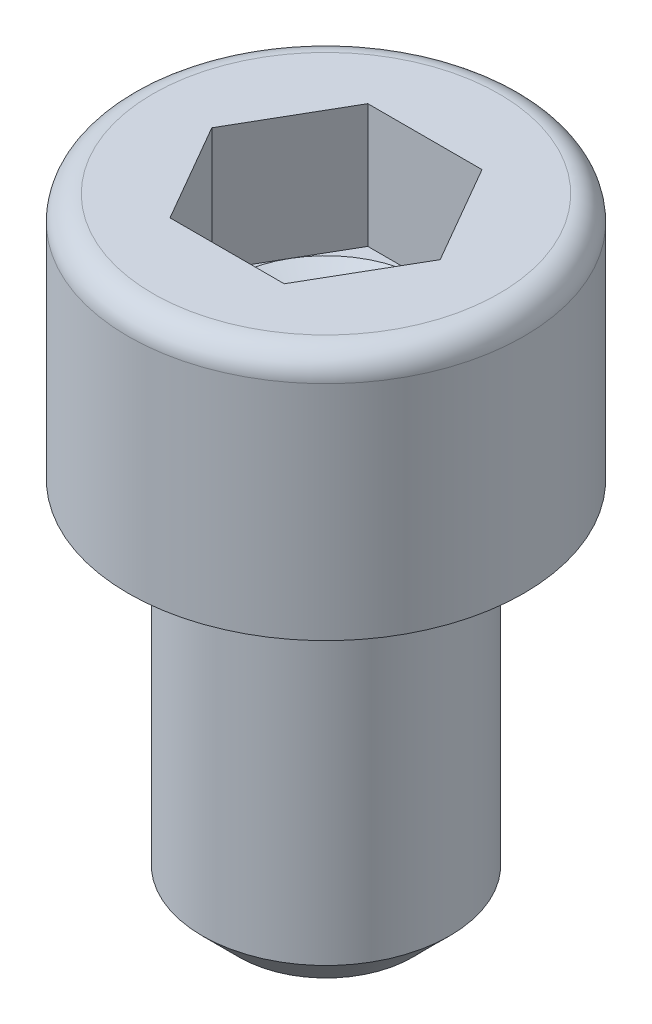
from build123d import *

# Parameters (mm, degrees)
TIGE_START              = -15
ESQUISSE1_R             = 5
TIGE_DEPTH              = 15
CHANFREIN_D_ENTR_E_SIZE = 1.5
HEXAGONE_DEPTH          = 5


with BuildPart() as part:
    # Esquisse1 → Tige (new body)
    with BuildSketch(Plane(origin=(0, 0, 0), x_dir=(1, 0, 0), z_dir=(0, 1, 0)).offset(TIGE_START)):
        with Locations(Location((0, 0, 0), (0, 0, 270))):
            Circle(ESQUISSE1_R)
    extrude(amount=TIGE_DEPTH)

    # Chanfrein d_entr_e
    chanfrein_d_entr_e_edges = [part.edges().sort_by_distance(p)[0] for p in [
        (0, -15, -5),
    ]]
    chamfer(chanfrein_d_entr_e_edges, length=CHANFREIN_D_ENTR_E_SIZE)

    # Esquisse2 → T_te (revolve)
    with BuildSketch(Plane.XY, mode=Mode.PRIVATE) as t_te_sk:
        with BuildLine():
            Line((4, 10), (4, 5))
            Line((4, 5), (0, 2.690598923))
            Line((0, 2.690598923), (0, 0))
            Line((0, 0), (8, 0))
            Line((8, 0), (8, 9))
            ThreePointArc((8, 9), (7.707106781, 9.707106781), (7, 10))
            Line((7, 10), (4, 10))
        make_face()
    revolve(t_te_sk.sketch.rotate(Axis((0, 10, 0), (0, -1, 0)), 180), axis=Axis((0, 10, 0), (0, -1, 0)))

    # Esquisse3 → Hexagone (cut)
    with BuildSketch(Plane(origin=(0, 10, -3), x_dir=(1, 0, 0), z_dir=(0, -1, 0))):
        Polygon((2.309401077, 7), (-2.309401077, 7), (-4.618802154, 3), (-2.309401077, -1), (2.309401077, -1), (4.618802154, 3), align=None)
    extrude(amount=HEXAGONE_DEPTH, mode=Mode.SUBTRACT)


solid = part.part
